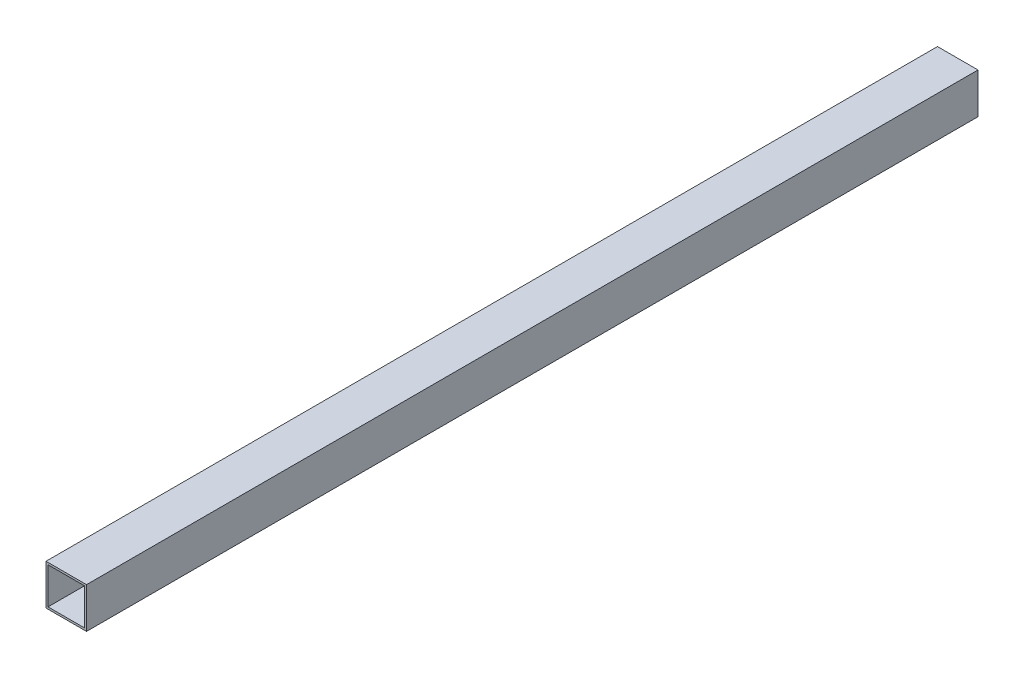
from build123d import *

# Parameters (mm, degrees)
ESQUISSE1_W        = 100
ESQUISSE1_H        = 100
ESQUISSE1_W_2      = 90
ESQUISSE1_H_2      = 90
BOSS_EXTRU_1_DEPTH = 2200


with BuildPart() as part:
    # Esquisse1 → Boss.-Extru.1 (new body)
    with BuildSketch(Plane.XY):
        with Locations((50, 50)):
            Rectangle(ESQUISSE1_W, ESQUISSE1_H)
        with Locations((50, 50)):
            Rectangle(ESQUISSE1_W_2, ESQUISSE1_H_2, mode=Mode.SUBTRACT)
    extrude(amount=BOSS_EXTRU_1_DEPTH)


solid = part.part
